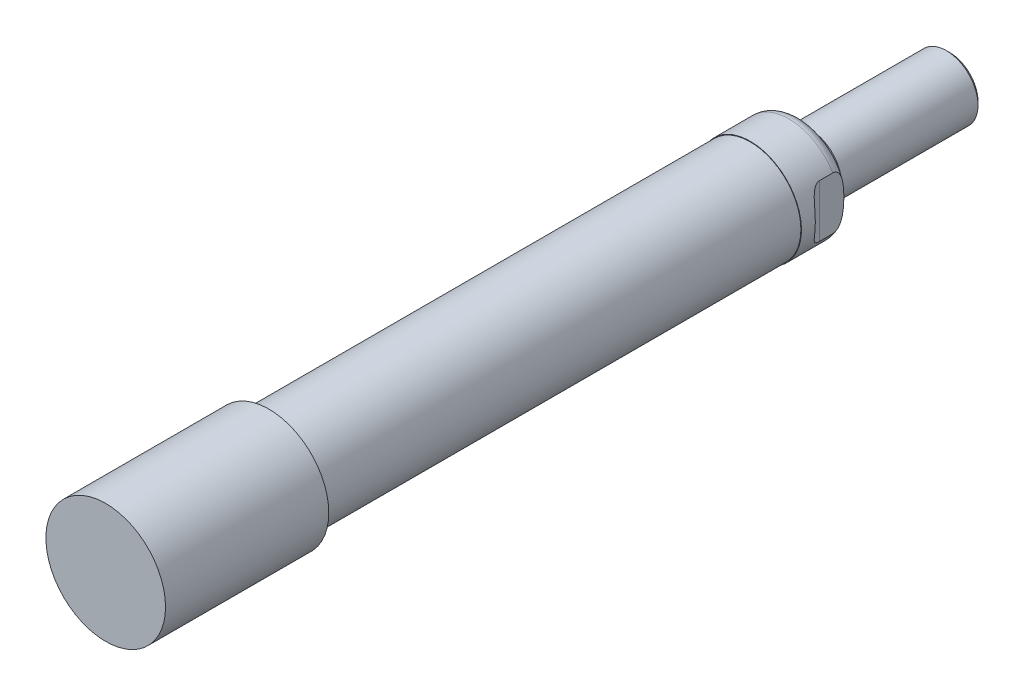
ISO-10303-21;
HEADER;
FILE_DESCRIPTION(('STEP AP214'),'2;1');
FILE_NAME('part.step','',(''),(''),'','','');
FILE_SCHEMA(('AUTOMOTIVE_DESIGN { 1 0 10303 214 1 1 1 1 }'));
ENDSEC;
DATA;
#1=APPLICATION_CONTEXT('core data for automotive mechanical design processes');
#2=APPLICATION_PROTOCOL_DEFINITION('international standard','automotive_design',2000,#1);
#3=PRODUCT_CONTEXT('',#1,'mechanical');
#4=PRODUCT('Part','Part','',(#3));
#5=PRODUCT_RELATED_PRODUCT_CATEGORY('part','',(#4));
#6=PRODUCT_DEFINITION_FORMATION('','',#4);
#7=PRODUCT_DEFINITION_CONTEXT('part definition',#1,'design');
#8=PRODUCT_DEFINITION('design','',#6,#7);
#9=PRODUCT_DEFINITION_SHAPE('','',#8);
#10=(LENGTH_UNIT() NAMED_UNIT(*) SI_UNIT(.MILLI.,.METRE.));
#11=(NAMED_UNIT(*) PLANE_ANGLE_UNIT() SI_UNIT($,.RADIAN.));
#12=(NAMED_UNIT(*) SI_UNIT($,.STERADIAN.) SOLID_ANGLE_UNIT());
#13=UNCERTAINTY_MEASURE_WITH_UNIT(LENGTH_MEASURE(1.E-05),#10,'distance_accuracy_value','');
#14=(GEOMETRIC_REPRESENTATION_CONTEXT(3) GLOBAL_UNCERTAINTY_ASSIGNED_CONTEXT((#13)) GLOBAL_UNIT_ASSIGNED_CONTEXT((#10,
#11,#12)) REPRESENTATION_CONTEXT('',''));
#15=CARTESIAN_POINT('',(0.,0.,0.));
#16=DIRECTION('',(0.,0.,1.));
#17=DIRECTION('',(1.,0.,0.));
#18=AXIS2_PLACEMENT_3D('',#15,#16,#17);
#19=CARTESIAN_POINT('',(0.,0.,0.));
#20=DIRECTION('',(0.,0.,1.));
#21=DIRECTION('',(1.,0.,0.));
#22=AXIS2_PLACEMENT_3D('',#19,#20,#21);
#23=CYLINDRICAL_SURFACE('',#22,12.69238);
#24=CARTESIAN_POINT('',(0.,0.,0.));
#25=DIRECTION('',(0.,0.,1.));
#26=DIRECTION('',(1.,0.,0.));
#27=AXIS2_PLACEMENT_3D('',#24,#25,#26);
#28=CIRCLE('',#27,12.69238);
#29=CARTESIAN_POINT('',(12.69238,0.,0.));
#30=VERTEX_POINT('',#29);
#31=EDGE_CURVE('E29',#30,#30,#28,.T.);
#32=ORIENTED_EDGE('',*,*,#31,.F.);
#33=EDGE_LOOP('',(#32));
#34=FACE_BOUND('',#33,.T.);
#35=CARTESIAN_POINT('',(0.,0.,-120.69739999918));
#36=DIRECTION('',(0.,0.,1.));
#37=DIRECTION('',(1.,0.,0.));
#38=AXIS2_PLACEMENT_3D('',#35,#36,#37);
#39=CIRCLE('',#38,12.69238);
#40=CARTESIAN_POINT('',(12.69238,0.,-120.69739999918));
#41=VERTEX_POINT('',#40);
#42=EDGE_CURVE('E10',#41,#41,#39,.T.);
#43=ORIENTED_EDGE('',*,*,#42,.T.);
#44=EDGE_LOOP('',(#43));
#45=FACE_BOUND('',#44,.T.);
#46=ADVANCED_FACE('F16',(#34,#45),#23,.T.);
#47=CARTESIAN_POINT('',(0.,0.,40.937999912));
#48=DIRECTION('',(0.,0.,-1.));
#49=DIRECTION('',(-1.,0.,0.));
#50=AXIS2_PLACEMENT_3D('',#47,#48,#49);
#51=PLANE('',#50);
#52=CARTESIAN_POINT('',(0.,0.,40.937999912));
#53=DIRECTION('',(0.,0.,1.));
#54=DIRECTION('',(1.,0.,0.));
#55=AXIS2_PLACEMENT_3D('',#52,#53,#54);
#56=CIRCLE('',#55,15.);
#57=CARTESIAN_POINT('',(15.,0.,40.937999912));
#58=VERTEX_POINT('',#57);
#59=EDGE_CURVE('E203',#58,#58,#56,.T.);
#60=ORIENTED_EDGE('',*,*,#59,.T.);
#61=EDGE_LOOP('',(#60));
#62=FACE_BOUND('',#61,.T.);
#63=ADVANCED_FACE('F177',(#62),#51,.F.);
#64=CARTESIAN_POINT('',(0.,0.,0.));
#65=DIRECTION('',(0.,0.,1.));
#66=DIRECTION('',(1.,0.,0.));
#67=AXIS2_PLACEMENT_3D('',#64,#65,#66);
#68=CYLINDRICAL_SURFACE('',#67,15.);
#69=ORIENTED_EDGE('',*,*,#59,.F.);
#70=EDGE_LOOP('',(#69));
#71=FACE_BOUND('',#70,.T.);
#72=CARTESIAN_POINT('',(0.,0.,0.));
#73=DIRECTION('',(0.,0.,1.));
#74=DIRECTION('',(1.,0.,0.));
#75=AXIS2_PLACEMENT_3D('',#72,#73,#74);
#76=CIRCLE('',#75,15.);
#77=CARTESIAN_POINT('',(15.,0.,0.));
#78=VERTEX_POINT('',#77);
#79=EDGE_CURVE('E201',#78,#78,#76,.T.);
#80=ORIENTED_EDGE('',*,*,#79,.T.);
#81=EDGE_LOOP('',(#80));
#82=FACE_BOUND('',#81,.T.);
#83=ADVANCED_FACE('F184',(#71,#82),#68,.T.);
#84=CARTESIAN_POINT('',(0.,15.,0.));
#85=DIRECTION('',(0.,0.,1.));
#86=DIRECTION('',(1.,0.,0.));
#87=AXIS2_PLACEMENT_3D('',#84,#85,#86);
#88=PLANE('',#87);
#89=ORIENTED_EDGE('',*,*,#79,.F.);
#90=EDGE_LOOP('',(#89));
#91=FACE_BOUND('',#90,.T.);
#92=ORIENTED_EDGE('',*,*,#31,.T.);
#93=EDGE_LOOP('',(#92));
#94=FACE_BOUND('',#93,.T.);
#95=ADVANCED_FACE('F139',(#91,#94),#88,.F.);
#96=CARTESIAN_POINT('',(0.,0.,-170.73539999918));
#97=DIRECTION('',(0.,0.,1.));
#98=DIRECTION('',(1.,0.,0.));
#99=AXIS2_PLACEMENT_3D('',#96,#97,#98);
#100=PLANE('',#99);
#101=CARTESIAN_POINT('',(0.,0.,-170.73539999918));
#102=DIRECTION('',(0.,0.,1.));
#103=DIRECTION('',(1.,0.,0.));
#104=AXIS2_PLACEMENT_3D('',#101,#102,#103);
#105=CIRCLE('',#104,7.0685);
#106=CARTESIAN_POINT('',(7.0685,0.,-170.73539999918));
#107=VERTEX_POINT('',#106);
#108=EDGE_CURVE('E89',#107,#107,#105,.T.);
#109=ORIENTED_EDGE('',*,*,#108,.F.);
#110=EDGE_LOOP('',(#109));
#111=FACE_BOUND('',#110,.T.);
#112=ADVANCED_FACE('F135',(#111),#100,.F.);
#113=CARTESIAN_POINT('',(0.,0.,-170.73539999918));
#114=DIRECTION('',(0.,0.,1.));
#115=DIRECTION('',(1.,0.,0.));
#116=AXIS2_PLACEMENT_3D('',#113,#114,#115);
#117=CONICAL_SURFACE('',#116,7.0685,0.785398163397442);
#118=CARTESIAN_POINT('',(0.,0.,-169.87889999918));
#119=DIRECTION('',(0.,0.,1.));
#120=DIRECTION('',(1.,0.,0.));
#121=AXIS2_PLACEMENT_3D('',#118,#119,#120);
#122=CIRCLE('',#121,7.925);
#123=CARTESIAN_POINT('',(7.925,0.,-169.87889999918));
#124=VERTEX_POINT('',#123);
#125=EDGE_CURVE('E92',#124,#124,#122,.T.);
#126=ORIENTED_EDGE('',*,*,#125,.F.);
#127=EDGE_LOOP('',(#126));
#128=FACE_BOUND('',#127,.T.);
#129=ORIENTED_EDGE('',*,*,#108,.T.);
#130=EDGE_LOOP('',(#129));
#131=FACE_BOUND('',#130,.T.);
#132=ADVANCED_FACE('F138',(#128,#131),#117,.T.);
#133=CARTESIAN_POINT('',(0.,0.,-95.5538097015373));
#134=DIRECTION('',(0.,0.,1.));
#135=DIRECTION('',(1.,0.,0.));
#136=AXIS2_PLACEMENT_3D('',#133,#134,#135);
#137=CYLINDRICAL_SURFACE('',#136,7.925);
#138=CARTESIAN_POINT('',(0.,0.,-135.68339999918));
#139=DIRECTION('',(0.,0.,1.));
#140=DIRECTION('',(1.,0.,0.));
#141=AXIS2_PLACEMENT_3D('',#138,#139,#140);
#142=CIRCLE('',#141,7.925);
#143=CARTESIAN_POINT('',(7.925,0.,-135.68339999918));
#144=VERTEX_POINT('',#143);
#145=EDGE_CURVE('E95',#144,#144,#142,.T.);
#146=ORIENTED_EDGE('',*,*,#145,.F.);
#147=EDGE_LOOP('',(#146));
#148=FACE_BOUND('',#147,.T.);
#149=ORIENTED_EDGE('',*,*,#125,.T.);
#150=EDGE_LOOP('',(#149));
#151=FACE_BOUND('',#150,.T.);
#152=ADVANCED_FACE('F143',(#148,#151),#137,.T.);
#153=CARTESIAN_POINT('',(0.,6.8961,-135.68339999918));
#154=DIRECTION('',(0.,0.,-1.));
#155=DIRECTION('',(-1.,0.,0.));
#156=AXIS2_PLACEMENT_3D('',#153,#154,#155);
#157=PLANE('',#156);
#158=CARTESIAN_POINT('',(0.,0.,-135.68339999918));
#159=DIRECTION('',(0.,0.,1.));
#160=DIRECTION('',(1.,0.,0.));
#161=AXIS2_PLACEMENT_3D('',#158,#159,#160);
#162=CIRCLE('',#161,6.8961);
#163=CARTESIAN_POINT('',(6.8961,0.,-135.68339999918));
#164=VERTEX_POINT('',#163);
#165=EDGE_CURVE('E98',#164,#164,#162,.T.);
#166=ORIENTED_EDGE('',*,*,#165,.F.);
#167=EDGE_LOOP('',(#166));
#168=FACE_BOUND('',#167,.T.);
#169=ORIENTED_EDGE('',*,*,#145,.T.);
#170=EDGE_LOOP('',(#169));
#171=FACE_BOUND('',#170,.T.);
#172=ADVANCED_FACE('F147',(#168,#171),#157,.F.);
#173=CARTESIAN_POINT('',(0.,0.,-135.49289999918));
#174=DIRECTION('',(0.,0.,1.));
#175=DIRECTION('',(1.,0.,0.));
#176=AXIS2_PLACEMENT_3D('',#173,#174,#175);
#177=TOROIDAL_SURFACE('',#176,6.8961,0.1905);
#178=CARTESIAN_POINT('',(0.,0.,-135.49289999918));
#179=DIRECTION('',(0.,0.,1.));
#180=DIRECTION('',(1.,0.,0.));
#181=AXIS2_PLACEMENT_3D('',#178,#179,#180);
#182=CIRCLE('',#181,6.7056);
#183=CARTESIAN_POINT('',(6.7056,0.,-135.49289999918));
#184=VERTEX_POINT('',#183);
#185=EDGE_CURVE('E101',#184,#184,#182,.T.);
#186=ORIENTED_EDGE('',*,*,#185,.F.);
#187=EDGE_LOOP('',(#186));
#188=FACE_BOUND('',#187,.T.);
#189=ORIENTED_EDGE('',*,*,#165,.T.);
#190=EDGE_LOOP('',(#189));
#191=FACE_BOUND('',#190,.T.);
#192=ADVANCED_FACE('F151',(#188,#191),#177,.F.);
#193=CARTESIAN_POINT('',(0.,0.,-95.5538097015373));
#194=DIRECTION('',(0.,0.,1.));
#195=DIRECTION('',(1.,0.,0.));
#196=AXIS2_PLACEMENT_3D('',#193,#194,#195);
#197=CYLINDRICAL_SURFACE('',#196,6.7056);
#198=CARTESIAN_POINT('',(0.,0.,-133.58789999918));
#199=DIRECTION('',(0.,0.,1.));
#200=DIRECTION('',(1.,0.,0.));
#201=AXIS2_PLACEMENT_3D('',#198,#199,#200);
#202=CIRCLE('',#201,6.7056);
#203=CARTESIAN_POINT('',(6.7056,0.,-133.58789999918));
#204=VERTEX_POINT('',#203);
#205=EDGE_CURVE('E104',#204,#204,#202,.T.);
#206=ORIENTED_EDGE('',*,*,#205,.F.);
#207=EDGE_LOOP('',(#206));
#208=FACE_BOUND('',#207,.T.);
#209=ORIENTED_EDGE('',*,*,#185,.T.);
#210=EDGE_LOOP('',(#209));
#211=FACE_BOUND('',#210,.T.);
#212=ADVANCED_FACE('F155',(#208,#211),#197,.T.);
#213=CARTESIAN_POINT('',(0.,0.,-133.58789999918));
#214=DIRECTION('',(0.,0.,1.));
#215=DIRECTION('',(1.,0.,0.));
#216=AXIS2_PLACEMENT_3D('',#213,#214,#215);
#217=TOROIDAL_SURFACE('',#216,6.8961,0.1905);
#218=CARTESIAN_POINT('',(0.,0.,-133.39739999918));
#219=DIRECTION('',(0.,0.,1.));
#220=DIRECTION('',(1.,0.,0.));
#221=AXIS2_PLACEMENT_3D('',#218,#219,#220);
#222=CIRCLE('',#221,6.8961);
#223=CARTESIAN_POINT('',(6.8961,0.,-133.39739999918));
#224=VERTEX_POINT('',#223);
#225=EDGE_CURVE('E107',#224,#224,#222,.T.);
#226=ORIENTED_EDGE('',*,*,#225,.F.);
#227=EDGE_LOOP('',(#226));
#228=FACE_BOUND('',#227,.T.);
#229=ORIENTED_EDGE('',*,*,#205,.T.);
#230=EDGE_LOOP('',(#229));
#231=FACE_BOUND('',#230,.T.);
#232=ADVANCED_FACE('F159',(#228,#231),#217,.F.);
#233=CARTESIAN_POINT('',(0.,9.827,-133.39739999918));
#234=DIRECTION('',(0.,0.,1.));
#235=DIRECTION('',(1.,0.,0.));
#236=AXIS2_PLACEMENT_3D('',#233,#234,#235);
#237=PLANE('',#236);
#238=CARTESIAN_POINT('',(0.,0.,-133.39739999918));
#239=DIRECTION('',(0.,0.,1.));
#240=DIRECTION('',(1.,0.,0.));
#241=AXIS2_PLACEMENT_3D('',#238,#239,#240);
#242=CIRCLE('',#241,9.827);
#243=CARTESIAN_POINT('',(9.827,0.,-133.39739999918));
#244=VERTEX_POINT('',#243);
#245=EDGE_CURVE('E110',#244,#244,#242,.T.);
#246=ORIENTED_EDGE('',*,*,#245,.F.);
#247=EDGE_LOOP('',(#246));
#248=FACE_BOUND('',#247,.T.);
#249=ORIENTED_EDGE('',*,*,#225,.T.);
#250=EDGE_LOOP('',(#249));
#251=FACE_BOUND('',#250,.T.);
#252=ADVANCED_FACE('F162',(#248,#251),#237,.F.);
#253=CARTESIAN_POINT('',(14.175,-13.589,-127.04739999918));
#254=DIRECTION('',(0.,1.,0.));
#255=DIRECTION('',(0.,0.,1.));
#256=AXIS2_PLACEMENT_3D('',#253,#254,#255);
#257=CYLINDRICAL_SURFACE('',#256,3.175);
#258=DIRECTION('',(0.,1.,0.));
#259=VECTOR('',#258,1.);
#260=CARTESIAN_POINT('',(11.,-13.589,-127.04739999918));
#261=LINE('',#260,#259);
#262=CARTESIAN_POINT('',(11.,-6.59787306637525,-127.04739999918));
#263=VERTEX_POINT('',#262);
#264=CARTESIAN_POINT('',(11.,6.59787306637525,-127.04739999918));
#265=VERTEX_POINT('',#264);
#266=EDGE_CURVE('E67',#263,#265,#261,.T.);
#267=ORIENTED_EDGE('',*,*,#266,.T.);
#268=CARTESIAN_POINT('',(12.827,0.,-129.922034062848));
#269=CARTESIAN_POINT('',(12.8270006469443,-0.268706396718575,-129.922032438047));
#270=CARTESIAN_POINT('',(12.8185521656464,-0.537405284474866,-129.918117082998));
#271=CARTESIAN_POINT('',(12.7848168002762,-1.07356137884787,-129.901935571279));
#272=CARTESIAN_POINT('',(12.7595266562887,-1.34101833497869,-129.889667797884));
#273=CARTESIAN_POINT('',(12.6924264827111,-1.87235964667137,-129.855249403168));
#274=CARTESIAN_POINT('',(12.6506688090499,-2.13625260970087,-129.833130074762));
#275=CARTESIAN_POINT('',(12.551075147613,-2.65955990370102,-129.776285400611));
#276=CARTESIAN_POINT('',(12.4932481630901,-2.91897665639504,-129.741567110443));
#277=CARTESIAN_POINT('',(12.3955653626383,-3.30135352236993,-129.67717195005));
#278=CARTESIAN_POINT('',(12.3614412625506,-3.42688052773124,-129.653847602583));
#279=CARTESIAN_POINT('',(12.2896809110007,-3.67592818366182,-129.602425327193));
#280=CARTESIAN_POINT('',(12.2520453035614,-3.79944919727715,-129.574328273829));
#281=CARTESIAN_POINT('',(12.1733916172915,-4.04438579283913,-129.512495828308));
#282=CARTESIAN_POINT('',(12.1323645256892,-4.16579465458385,-129.478745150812));
#283=CARTESIAN_POINT('',(12.0473665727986,-4.40557163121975,-129.404724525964));
#284=CARTESIAN_POINT('',(12.0033958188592,-4.52393985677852,-129.364454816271));
#285=CARTESIAN_POINT('',(11.9123351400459,-4.75859923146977,-129.275645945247));
#286=CARTESIAN_POINT('',(11.8652086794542,-4.87483370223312,-129.226993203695));
#287=CARTESIAN_POINT('',(11.7691575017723,-5.10236285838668,-129.120488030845));
#288=CARTESIAN_POINT('',(11.7202319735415,-5.21365526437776,-129.062631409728));
#289=CARTESIAN_POINT('',(11.621957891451,-5.429177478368,-128.936568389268));
#290=CARTESIAN_POINT('',(11.5726129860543,-5.53344179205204,-128.868418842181));
#291=CARTESIAN_POINT('',(11.4748714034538,-5.73337583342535,-128.720065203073));
#292=CARTESIAN_POINT('',(11.4264734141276,-5.82905822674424,-128.639879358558));
#293=CARTESIAN_POINT('',(11.3379215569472,-5.99930417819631,-128.475456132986));
#294=CARTESIAN_POINT('',(11.2974443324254,-6.07503291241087,-128.392615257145));
#295=CARTESIAN_POINT('',(11.2211290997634,-6.21486401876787,-128.21554189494));
#296=CARTESIAN_POINT('',(11.1852916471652,-6.27896499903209,-128.121308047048));
#297=CARTESIAN_POINT('',(11.1206016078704,-6.39284793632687,-127.920611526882));
#298=CARTESIAN_POINT('',(11.0918341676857,-6.44245658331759,-127.81402058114));
#299=CARTESIAN_POINT('',(11.0449485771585,-6.52251798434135,-127.591669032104));
#300=CARTESIAN_POINT('',(11.0268129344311,-6.55300220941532,-127.475923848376));
#301=CARTESIAN_POINT('',(11.0050476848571,-6.58948010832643,-127.254354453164));
#302=CARTESIAN_POINT('',(10.9998823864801,-6.59806860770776,-127.14910976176));
#303=CARTESIAN_POINT('',(11.0001214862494,-6.59767106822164,-126.938676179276));
#304=CARTESIAN_POINT('',(11.0055222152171,-6.5886911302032,-126.833487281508));
#305=CARTESIAN_POINT('',(11.0249837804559,-6.55606201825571,-126.639506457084));
#306=CARTESIAN_POINT('',(11.0379211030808,-6.53431349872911,-126.550267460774));
#307=CARTESIAN_POINT('',(11.0703780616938,-6.47917273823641,-126.376769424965));
#308=CARTESIAN_POINT('',(11.0898991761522,-6.4457778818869,-126.292511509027));
#309=CARTESIAN_POINT('',(11.142561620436,-6.354443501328,-126.09957879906));
#310=CARTESIAN_POINT('',(11.1780628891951,-6.29199722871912,-125.9936872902));
#311=CARTESIAN_POINT('',(11.2555606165,-6.15228870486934,-125.79481926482));
#312=CARTESIAN_POINT('',(11.2975704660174,-6.07499582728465,-125.701870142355));
#313=CARTESIAN_POINT('',(11.3740280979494,-5.93028966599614,-125.550595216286));
#314=CARTESIAN_POINT('',(11.4076958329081,-5.86533333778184,-125.489463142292));
#315=CARTESIAN_POINT('',(11.4761103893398,-5.7303179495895,-125.373738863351));
#316=CARTESIAN_POINT('',(11.5108577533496,-5.66025629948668,-125.319150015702));
#317=CARTESIAN_POINT('',(11.580721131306,-5.51591033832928,-125.215943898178));
#318=CARTESIAN_POINT('',(11.6158375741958,-5.44162053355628,-125.167334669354));
#319=CARTESIAN_POINT('',(11.6858415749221,-5.28961727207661,-125.075588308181));
#320=CARTESIAN_POINT('',(11.7207290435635,-5.21190256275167,-125.032453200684));
#321=CARTESIAN_POINT('',(11.8154406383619,-4.99498140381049,-124.920954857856));
#322=CARTESIAN_POINT('',(11.8745797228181,-4.85289540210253,-124.857592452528));
#323=CARTESIAN_POINT('',(11.9891935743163,-4.56241341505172,-124.743181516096));
#324=CARTESIAN_POINT('',(12.0446655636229,-4.41401278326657,-124.69214224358));
#325=CARTESIAN_POINT('',(12.1510125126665,-4.11223366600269,-124.60014702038));
#326=CARTESIAN_POINT('',(12.2018792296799,-3.95884689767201,-124.559208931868));
#327=CARTESIAN_POINT('',(12.2982733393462,-3.64840228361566,-124.485722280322));
#328=CARTESIAN_POINT('',(12.3437989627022,-3.49134324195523,-124.453176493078));
#329=CARTESIAN_POINT('',(12.4233553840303,-3.19567884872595,-124.398936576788));
#330=CARTESIAN_POINT('',(12.4581089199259,-3.05742452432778,-124.376372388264));
#331=CARTESIAN_POINT('',(12.5231131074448,-2.77920652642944,-124.335692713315));
#332=CARTESIAN_POINT('',(12.553363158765,-2.63924262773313,-124.317577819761));
#333=CARTESIAN_POINT('',(12.6371794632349,-2.21717598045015,-124.268915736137));
#334=CARTESIAN_POINT('',(12.6837855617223,-1.93299577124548,-124.244067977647));
#335=CARTESIAN_POINT('',(12.7578770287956,-1.36086538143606,-124.205904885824));
#336=CARTESIAN_POINT('',(12.7853224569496,-1.0729085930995,-124.192613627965));
#337=CARTESIAN_POINT('',(12.8206829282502,-0.495595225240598,-124.175669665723));
#338=CARTESIAN_POINT('',(12.8286032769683,-0.206239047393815,-124.172014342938));
#339=CARTESIAN_POINT('',(12.8247765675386,0.385076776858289,-124.173808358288));
#340=CARTESIAN_POINT('',(12.8121465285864,0.687029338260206,-124.179666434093));
#341=CARTESIAN_POINT('',(12.76563105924,1.28908038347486,-124.202228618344));
#342=CARTESIAN_POINT('',(12.7317365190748,1.58917801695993,-124.218937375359));
#343=CARTESIAN_POINT('',(12.6653524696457,2.0355131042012,-124.254161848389));
#344=CARTESIAN_POINT('',(12.640698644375,2.18336505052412,-124.267560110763));
#345=CARTESIAN_POINT('',(12.5863116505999,2.47771503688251,-124.298276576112));
#346=CARTESIAN_POINT('',(12.5565791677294,2.62421325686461,-124.315594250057));
#347=CARTESIAN_POINT('',(12.4921854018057,2.9153814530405,-124.354784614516));
#348=CARTESIAN_POINT('',(12.4575282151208,3.06005284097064,-124.376653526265));
#349=CARTESIAN_POINT('',(12.3834551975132,3.34722888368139,-124.425764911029));
#350=CARTESIAN_POINT('',(12.3440405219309,3.48973405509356,-124.453006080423));
#351=CARTESIAN_POINT('',(12.2718676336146,3.73427642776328,-124.505720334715));
#352=CARTESIAN_POINT('',(12.2401497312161,3.8369403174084,-124.529716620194));
#353=CARTESIAN_POINT('',(12.1744548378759,4.04054657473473,-124.581594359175));
#354=CARTESIAN_POINT('',(12.1404780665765,4.14148910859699,-124.609475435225));
#355=CARTESIAN_POINT('',(12.0704124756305,4.34146410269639,-124.669696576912));
#356=CARTESIAN_POINT('',(12.0343208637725,4.44049379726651,-124.702042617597));
#357=CARTESIAN_POINT('',(11.9603330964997,4.63608580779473,-124.771776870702));
#358=CARTESIAN_POINT('',(11.9224369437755,4.73264812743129,-124.809165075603));
#359=CARTESIAN_POINT('',(11.8448111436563,4.92372983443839,-124.890082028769));
#360=CARTESIAN_POINT('',(11.8050669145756,5.0182190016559,-124.933668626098));
#361=CARTESIAN_POINT('',(11.724597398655,5.20345470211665,-125.027505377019));
#362=CARTESIAN_POINT('',(11.6838718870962,5.29420036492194,-125.077757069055));
#363=CARTESIAN_POINT('',(11.6022467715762,5.47076103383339,-125.185645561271));
#364=CARTESIAN_POINT('',(11.5613479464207,5.55658882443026,-125.243261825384));
#365=CARTESIAN_POINT('',(11.4802322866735,5.72229837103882,-125.366831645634));
#366=CARTESIAN_POINT('',(11.4400149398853,5.802184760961,-125.432778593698));
#367=CARTESIAN_POINT('',(11.3572443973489,5.96271064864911,-125.581494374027));
#368=CARTESIAN_POINT('',(11.3149050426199,6.04250744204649,-125.665309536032));
#369=CARTESIAN_POINT('',(11.2348293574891,6.19012083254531,-125.845033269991));
#370=CARTESIAN_POINT('',(11.1970931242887,6.25793717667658,-125.940942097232));
#371=CARTESIAN_POINT('',(11.128715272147,6.3787552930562,-126.145969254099));
#372=CARTESIAN_POINT('',(11.098168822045,6.43156007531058,-126.255238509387));
#373=CARTESIAN_POINT('',(11.0482516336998,6.51694473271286,-126.483795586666));
#374=CARTESIAN_POINT('',(11.0288594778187,6.54956337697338,-126.603063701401));
#375=CARTESIAN_POINT('',(11.0057736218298,6.58827028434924,-126.829199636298));
#376=CARTESIAN_POINT('',(11.0001989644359,6.59754065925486,-126.935330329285));
#377=CARTESIAN_POINT('',(10.9998120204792,6.59818715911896,-127.147657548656));
#378=CARTESIAN_POINT('',(11.0049956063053,6.58957014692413,-127.253854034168));
#379=CARTESIAN_POINT('',(11.0241644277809,6.55743862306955,-127.448936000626));
#380=CARTESIAN_POINT('',(11.0369358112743,6.53597607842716,-127.538295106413));
#381=CARTESIAN_POINT('',(11.0690932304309,6.48136604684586,-127.712068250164));
#382=CARTESIAN_POINT('',(11.0884805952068,6.44821621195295,-127.796481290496));
#383=CARTESIAN_POINT('',(11.1407633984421,6.35759036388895,-127.989422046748));
#384=CARTESIAN_POINT('',(11.176000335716,6.29565265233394,-128.095213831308));
#385=CARTESIAN_POINT('',(11.2529937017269,6.15697528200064,-128.293968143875));
#386=CARTESIAN_POINT('',(11.294763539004,6.08020510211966,-128.3869035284));
#387=CARTESIAN_POINT('',(11.370782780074,5.93650304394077,-128.53810818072));
#388=CARTESIAN_POINT('',(11.4042410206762,5.87203904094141,-128.599180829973));
#389=CARTESIAN_POINT('',(11.4722553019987,5.73802693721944,-128.714820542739));
#390=CARTESIAN_POINT('',(11.5068118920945,5.66847626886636,-128.769384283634));
#391=CARTESIAN_POINT('',(11.6110663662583,5.45346713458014,-128.924214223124));
#392=CARTESIAN_POINT('',(11.6812870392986,5.30176672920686,-129.015503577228));
#393=CARTESIAN_POINT('',(11.810013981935,5.00778913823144,-129.167785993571));
#394=CARTESIAN_POINT('',(11.8688574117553,4.86684600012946,-129.231173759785));
#395=CARTESIAN_POINT('',(11.9830054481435,4.57859491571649,-129.345730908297));
#396=CARTESIAN_POINT('',(12.0383073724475,4.43128228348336,-129.396891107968));
#397=CARTESIAN_POINT('',(12.1443997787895,4.1316839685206,-129.489168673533));
#398=CARTESIAN_POINT('',(12.1951815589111,3.97938943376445,-129.53026692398));
#399=CARTESIAN_POINT('',(12.2914956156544,3.67112407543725,-129.60410019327));
#400=CARTESIAN_POINT('',(12.3370261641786,3.51515206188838,-129.636832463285));
#401=CARTESIAN_POINT('',(12.4162972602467,3.22289185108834,-129.691176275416));
#402=CARTESIAN_POINT('',(12.4507928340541,3.08697610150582,-129.713708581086));
#403=CARTESIAN_POINT('',(12.5154354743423,2.81346117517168,-129.754413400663));
#404=CARTESIAN_POINT('',(12.5455819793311,2.67586178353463,-129.772585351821));
#405=CARTESIAN_POINT('',(12.6293223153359,2.2609156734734,-129.821521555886));
#406=CARTESIAN_POINT('',(12.6761913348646,1.98151526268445,-129.846689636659));
#407=CARTESIAN_POINT('',(12.7514128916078,1.41916990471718,-129.885672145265));
#408=CARTESIAN_POINT('',(12.7797420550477,1.13622093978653,-129.899472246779));
#409=CARTESIAN_POINT('',(12.8175325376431,0.568844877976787,-129.917652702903));
#410=CARTESIAN_POINT('',(12.8269993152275,0.284418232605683,-129.922035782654));
#411=CARTESIAN_POINT('',(12.827,0.,-129.922034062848));
#412=B_SPLINE_CURVE_WITH_KNOTS('',3,(#268,#269,#270,#271,#272,#273,#274,#275,#276,#277,#278,
#279,#280,#281,#282,#283,#284,#285,#286,#287,#288,#289,#290,#291,#292,#293,#294,#295,#296,#297,
#298,#299,#300,#301,#302,#303,#304,#305,#306,#307,#308,#309,#310,#311,#312,#313,#314,#315,#316,
#317,#318,#319,#320,#321,#322,#323,#324,#325,#326,#327,#328,#329,#330,#331,#332,#333,#334,#335,
#336,#337,#338,#339,#340,#341,#342,#343,#344,#345,#346,#347,#348,#349,#350,#351,#352,#353,#354,
#355,#356,#357,#358,#359,#360,#361,#362,#363,#364,#365,#366,#367,#368,#369,#370,#371,#372,#373,
#374,#375,#376,#377,#378,#379,#380,#381,#382,#383,#384,#385,#386,#387,#388,#389,#390,#391,#392,
#393,#394,#395,#396,#397,#398,#399,#400,#401,#402,#403,#404,#405,#406,#407,#408,#409,#410,#411),
.UNSPECIFIED.,.T.,.F.,(4,2,2,2,2,2,2,2,2,2,2,2,2,2,2,2,2,2,2,2,2,2,2,2,2,2,2,2,2,2,2,2,2,2,2,2,
2,2,2,2,2,2,2,2,2,2,2,2,2,2,2,2,2,2,2,2,2,2,2,2,2,2,2,2,2,2,2,2,2,2,2,4),(0.,0.805944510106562,
1.61204506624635,2.4156031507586,3.21871192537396,3.61506493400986,4.01134539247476,
4.40871507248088,4.80607026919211,5.20930705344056,5.61272792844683,6.01399694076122,
6.41466364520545,6.77161676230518,7.12861257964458,7.48971755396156,7.85022672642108,
8.16546211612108,8.48058805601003,8.75769226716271,9.03485874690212,9.41660872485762,
9.79915482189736,10.0847983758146,10.3705878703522,10.6567575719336,10.9430328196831,
11.4415134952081,11.94036753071,12.44009747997,12.9399925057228,13.3728240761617,
13.8057132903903,14.6717977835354,15.5396822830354,16.4073309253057,17.3132532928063,
18.2195640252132,18.6709220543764,19.1222191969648,19.5731431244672,20.0239577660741,
20.3541623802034,20.6843349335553,21.0149536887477,21.3455719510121,21.6795075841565,
22.0135204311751,22.3466214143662,22.6794598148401,23.0480879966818,23.4167239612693,
23.7899949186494,24.1625467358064,24.4806188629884,24.7985689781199,25.0757488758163,
25.3529844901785,25.7335319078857,26.1148708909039,26.3991682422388,26.6836101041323,
27.2530112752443,27.7484789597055,28.244317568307,28.7410909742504,29.2380273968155,
29.6639465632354,30.0899206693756,30.9421650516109,31.795481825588,32.648551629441),.UNSPECIFIED.);
#413=EDGE_CURVE('E65',#263,#265,#412,.T.);
#414=ORIENTED_EDGE('',*,*,#413,.F.);
#415=EDGE_LOOP('',(#267,#414));
#416=FACE_BOUND('',#415,.T.);
#417=ADVANCED_FACE('F66',(#416),#257,.F.);
#418=CARTESIAN_POINT('',(11.,-13.589,-133.39739999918));
#419=DIRECTION('',(-1.,0.,0.));
#420=DIRECTION('',(0.,0.,1.));
#421=AXIS2_PLACEMENT_3D('',#418,#419,#420);
#422=PLANE('',#421);
#423=CARTESIAN_POINT('',(11.,0.,-133.158572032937));
#424=CARTESIAN_POINT('',(11.,-0.235247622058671,-133.158566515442));
#425=CARTESIAN_POINT('',(11.,-0.470493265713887,-133.155397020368));
#426=CARTESIAN_POINT('',(11.,-0.940835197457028,-133.142316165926));
#427=CARTESIAN_POINT('',(11.,-1.17593146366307,-133.132403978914));
#428=CARTESIAN_POINT('',(11.,-1.64591775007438,-133.104650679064));
#429=CARTESIAN_POINT('',(11.,-1.88080729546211,-133.086801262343));
#430=CARTESIAN_POINT('',(11.,-2.34961125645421,-133.041173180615));
#431=CARTESIAN_POINT('',(11.,-2.58352588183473,-133.013396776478));
#432=CARTESIAN_POINT('',(11.,-2.99896168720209,-132.95240929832));
#433=CARTESIAN_POINT('',(11.,-3.1808422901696,-132.921683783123));
#434=CARTESIAN_POINT('',(11.,-3.54279949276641,-132.850474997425));
#435=CARTESIAN_POINT('',(11.,-3.72287538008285,-132.809988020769));
#436=CARTESIAN_POINT('',(11.,-4.07918992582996,-132.717145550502));
#437=CARTESIAN_POINT('',(11.,-4.25544154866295,-132.664840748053));
#438=CARTESIAN_POINT('',(11.,-4.60279770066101,-132.545474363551));
#439=CARTESIAN_POINT('',(11.,-4.77390771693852,-132.478429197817));
#440=CARTESIAN_POINT('',(11.,-5.07702851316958,-132.340171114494));
#441=CARTESIAN_POINT('',(11.,-5.21041921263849,-132.272020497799));
#442=CARTESIAN_POINT('',(11.,-5.46918637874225,-132.121256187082));
#443=CARTESIAN_POINT('',(11.,-5.59455136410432,-132.038622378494));
#444=CARTESIAN_POINT('',(11.,-5.83424377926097,-131.855585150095));
#445=CARTESIAN_POINT('',(11.,-5.94841927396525,-131.754978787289));
#446=CARTESIAN_POINT('',(11.,-6.15698920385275,-131.534977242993));
#447=CARTESIAN_POINT('',(11.,-6.25144900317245,-131.415646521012));
#448=CARTESIAN_POINT('',(11.,-6.38205172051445,-131.205902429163));
#449=CARTESIAN_POINT('',(11.,-6.42688252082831,-131.120904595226));
#450=CARTESIAN_POINT('',(11.,-6.50221817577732,-130.944737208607));
#451=CARTESIAN_POINT('',(11.,-6.53273441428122,-130.853572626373));
#452=CARTESIAN_POINT('',(11.,-6.57724977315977,-130.666596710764));
#453=CARTESIAN_POINT('',(11.,-6.59113988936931,-130.570758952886));
#454=CARTESIAN_POINT('',(11.,-6.60075639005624,-130.378173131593));
#455=CARTESIAN_POINT('',(11.,-6.59648730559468,-130.281425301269));
#456=CARTESIAN_POINT('',(11.,-6.57141197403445,-130.099106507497));
#457=CARTESIAN_POINT('',(11.,-6.55213996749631,-130.013317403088));
#458=CARTESIAN_POINT('',(11.,-6.50034463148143,-129.845879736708));
#459=CARTESIAN_POINT('',(11.,-6.46781725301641,-129.764232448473));
#460=CARTESIAN_POINT('',(11.,-6.37860257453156,-129.579986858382));
#461=CARTESIAN_POINT('',(11.,-6.31747124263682,-129.479544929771));
#462=CARTESIAN_POINT('',(11.,-6.17978674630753,-129.289848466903));
#463=CARTESIAN_POINT('',(11.,-6.10319990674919,-129.200619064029));
#464=CARTESIAN_POINT('',(11.,-5.89835405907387,-128.992212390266));
#465=CARTESIAN_POINT('',(11.,-5.76319645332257,-128.879863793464));
#466=CARTESIAN_POINT('',(11.,-5.47762736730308,-128.677113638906));
#467=CARTESIAN_POINT('',(11.,-5.3271955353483,-128.586741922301));
#468=CARTESIAN_POINT('',(11.,-5.03096035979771,-128.43163530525));
#469=CARTESIAN_POINT('',(11.,-4.88596547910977,-128.365322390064));
#470=CARTESIAN_POINT('',(11.,-4.59078239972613,-128.245296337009));
#471=CARTESIAN_POINT('',(11.,-4.44058958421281,-128.191594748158));
#472=CARTESIAN_POINT('',(11.,-4.13619184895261,-128.09449924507));
#473=CARTESIAN_POINT('',(11.,-3.98197150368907,-128.051154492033));
#474=CARTESIAN_POINT('',(11.,-3.67143699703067,-127.973321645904));
#475=CARTESIAN_POINT('',(11.,-3.51512398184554,-127.938828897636));
#476=CARTESIAN_POINT('',(11.,-3.10051431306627,-127.857399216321));
#477=CARTESIAN_POINT('',(11.,-2.84101265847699,-127.816638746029));
#478=CARTESIAN_POINT('',(11.,-2.32008586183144,-127.749670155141));
#479=CARTESIAN_POINT('',(11.,-2.05865958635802,-127.72347144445));
#480=CARTESIAN_POINT('',(11.,-1.53417590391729,-127.682090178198));
#481=CARTESIAN_POINT('',(11.,-1.27111595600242,-127.666940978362));
#482=CARTESIAN_POINT('',(11.,-0.744724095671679,-127.645581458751));
#483=CARTESIAN_POINT('',(11.,-0.481392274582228,-127.639368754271));
#484=CARTESIAN_POINT('',(11.,0.0455988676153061,-127.634922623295));
#485=CARTESIAN_POINT('',(11.,0.309258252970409,-127.636697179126));
#486=CARTESIAN_POINT('',(11.,0.836458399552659,-127.648519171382));
#487=CARTESIAN_POINT('',(11.,1.09999912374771,-127.658568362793));
#488=CARTESIAN_POINT('',(11.,1.62584348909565,-127.688418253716));
#489=CARTESIAN_POINT('',(11.,1.8881485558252,-127.708192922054));
#490=CARTESIAN_POINT('',(11.,2.41147381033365,-127.760242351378));
#491=CARTESIAN_POINT('',(11.,2.67249453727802,-127.792511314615));
#492=CARTESIAN_POINT('',(11.,3.09542675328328,-127.858674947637));
#493=CARTESIAN_POINT('',(11.,3.25812392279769,-127.887509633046));
#494=CARTESIAN_POINT('',(11.,3.58199478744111,-127.953201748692));
#495=CARTESIAN_POINT('',(11.,3.74316778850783,-127.990062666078));
#496=CARTESIAN_POINT('',(11.,4.06223074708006,-128.073272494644));
#497=CARTESIAN_POINT('',(11.,4.22013305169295,-128.11957327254));
#498=CARTESIAN_POINT('',(11.,4.53201190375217,-128.223764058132));
#499=CARTESIAN_POINT('',(11.,4.68599115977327,-128.281645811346));
#500=CARTESIAN_POINT('',(11.,4.99410080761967,-128.414047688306));
#501=CARTESIAN_POINT('',(11.,5.14798871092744,-128.489142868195));
#502=CARTESIAN_POINT('',(11.,5.44570190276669,-128.657817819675));
#503=CARTESIAN_POINT('',(11.,5.58952250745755,-128.751406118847));
#504=CARTESIAN_POINT('',(11.,5.83221957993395,-128.938478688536));
#505=CARTESIAN_POINT('',(11.,5.93420267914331,-129.02788521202));
#506=CARTESIAN_POINT('',(11.,6.12294376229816,-129.22156927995));
#507=CARTESIAN_POINT('',(11.,6.20973462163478,-129.325813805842));
#508=CARTESIAN_POINT('',(11.,6.34141679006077,-129.519255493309));
#509=CARTESIAN_POINT('',(11.,6.39130707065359,-129.605029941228));
#510=CARTESIAN_POINT('',(11.,6.4765495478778,-129.783585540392));
#511=CARTESIAN_POINT('',(11.,6.51191150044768,-129.87636194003));
#512=CARTESIAN_POINT('',(11.,6.56556463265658,-130.067596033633));
#513=CARTESIAN_POINT('',(11.,6.58372131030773,-130.166092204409));
#514=CARTESIAN_POINT('',(11.,6.60072658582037,-130.364733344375));
#515=CARTESIAN_POINT('',(11.,6.59958533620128,-130.464877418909));
#516=CARTESIAN_POINT('',(11.,6.57940404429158,-130.651535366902));
#517=CARTESIAN_POINT('',(11.,6.56245104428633,-130.738285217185));
#518=CARTESIAN_POINT('',(11.,6.51486797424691,-130.907916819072));
#519=CARTESIAN_POINT('',(11.,6.48423316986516,-130.990797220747));
#520=CARTESIAN_POINT('',(11.,6.40020486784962,-131.175207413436));
#521=CARTESIAN_POINT('',(11.,6.3427415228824,-131.274877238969));
#522=CARTESIAN_POINT('',(11.,6.21243394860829,-131.463566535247));
#523=CARTESIAN_POINT('',(11.,6.13956118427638,-131.552565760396));
#524=CARTESIAN_POINT('',(11.,5.94530576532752,-131.759340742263));
#525=CARTESIAN_POINT('',(11.,5.81727690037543,-131.870829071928));
#526=CARTESIAN_POINT('',(11.,5.54582767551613,-132.072917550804));
#527=CARTESIAN_POINT('',(11.,5.40237638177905,-132.163474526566));
#528=CARTESIAN_POINT('',(11.,5.12144094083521,-132.318333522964));
#529=CARTESIAN_POINT('',(11.,4.98490407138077,-132.384391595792));
#530=CARTESIAN_POINT('',(11.,4.70661680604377,-132.504584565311));
#531=CARTESIAN_POINT('',(11.,4.56486202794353,-132.55870916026));
#532=CARTESIAN_POINT('',(11.,4.27765571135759,-132.656997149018));
#533=CARTESIAN_POINT('',(11.,4.13219693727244,-132.701139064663));
#534=CARTESIAN_POINT('',(11.,3.83894997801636,-132.780964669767));
#535=CARTESIAN_POINT('',(11.,3.69116092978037,-132.816645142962));
#536=CARTESIAN_POINT('',(11.,3.39760623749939,-132.880129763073));
#537=CARTESIAN_POINT('',(11.,3.25187625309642,-132.908101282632));
#538=CARTESIAN_POINT('',(11.,2.95942360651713,-132.958332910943));
#539=CARTESIAN_POINT('',(11.,2.81270078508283,-132.98059207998));
#540=CARTESIAN_POINT('',(11.,2.51851404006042,-133.020289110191));
#541=CARTESIAN_POINT('',(11.,2.37104968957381,-133.037723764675));
#542=CARTESIAN_POINT('',(11.,2.07568722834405,-133.068468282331));
#543=CARTESIAN_POINT('',(11.,1.9277890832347,-133.081777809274));
#544=CARTESIAN_POINT('',(11.,1.48370488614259,-133.116420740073));
#545=CARTESIAN_POINT('',(11.,1.18710469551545,-133.132471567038));
#546=CARTESIAN_POINT('',(11.,0.59366852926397,-133.153548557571));
#547=CARTESIAN_POINT('',(11.,0.296832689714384,-133.158578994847));
#548=CARTESIAN_POINT('',(11.,0.,-133.158572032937));
#549=B_SPLINE_CURVE_WITH_KNOTS('',3,(#423,#424,#425,#426,#427,#428,#429,#430,#431,#432,#433,
#434,#435,#436,#437,#438,#439,#440,#441,#442,#443,#444,#445,#446,#447,#448,#449,#450,#451,#452,
#453,#454,#455,#456,#457,#458,#459,#460,#461,#462,#463,#464,#465,#466,#467,#468,#469,#470,#471,
#472,#473,#474,#475,#476,#477,#478,#479,#480,#481,#482,#483,#484,#485,#486,#487,#488,#489,#490,
#491,#492,#493,#494,#495,#496,#497,#498,#499,#500,#501,#502,#503,#504,#505,#506,#507,#508,#509,
#510,#511,#512,#513,#514,#515,#516,#517,#518,#519,#520,#521,#522,#523,#524,#525,#526,#527,#528,
#529,#530,#531,#532,#533,#534,#535,#536,#537,#538,#539,#540,#541,#542,#543,#544,#545,#546,#547,
#548),.UNSPECIFIED.,.T.,.F.,(4,2,2,2,2,2,2,2,2,2,2,2,2,2,2,2,2,2,2,2,2,2,2,2,2,2,2,2,2,2,2,2,2,
2,2,2,2,2,2,2,2,2,2,2,2,2,2,2,2,2,2,2,2,2,2,2,2,2,2,2,2,2,4),(0.,0.705716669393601,
1.41151997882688,2.11806343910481,2.82444608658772,3.37761348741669,3.93099124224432,
4.48203895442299,5.0324760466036,5.48114601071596,5.93044410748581,6.38517954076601,
6.8383825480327,7.1256030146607,7.41259467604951,7.70145778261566,7.99024881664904,
8.25285984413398,8.51555114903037,8.86633809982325,9.21789777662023,9.74220461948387,
10.2672194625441,10.7448305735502,11.2228773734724,11.7031501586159,12.1831698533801,
12.9705914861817,13.7585213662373,14.5488200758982,15.3389078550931,16.129785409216,
16.9208307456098,17.709770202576,18.4983440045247,18.9938849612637,19.4896416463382,
19.982931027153,20.4758700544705,20.988614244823,21.5015954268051,21.907212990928,
22.3119416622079,22.6085194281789,22.9048977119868,23.2035742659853,23.5020936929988,
23.7660600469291,24.0301178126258,24.3733550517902,24.7172335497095,25.2236859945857,
25.731173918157,26.1855381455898,26.6402930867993,27.0960173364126,27.5519145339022,
27.9969520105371,28.4420626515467,28.887468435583,29.3329105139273,30.223721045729,
31.1141860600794),.UNSPECIFIED.);
#550=CARTESIAN_POINT('',(11.,6.59787306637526,-130.39739999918));
#551=VERTEX_POINT('',#550);
#552=CARTESIAN_POINT('',(11.,-6.59787306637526,-130.39739999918));
#553=VERTEX_POINT('',#552);
#554=EDGE_CURVE('E115',#551,#553,#549,.T.);
#555=ORIENTED_EDGE('',*,*,#554,.F.);
#556=DIRECTION('',(0.,0.,1.));
#557=VECTOR('',#556,1.);
#558=CARTESIAN_POINT('',(11.,6.59787306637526,-95.5538097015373));
#559=LINE('',#558,#557);
#560=EDGE_CURVE('E72',#265,#551,#559,.F.);
#561=ORIENTED_EDGE('',*,*,#560,.F.);
#562=ORIENTED_EDGE('',*,*,#266,.F.);
#563=DIRECTION('',(0.,0.,1.));
#564=VECTOR('',#563,1.);
#565=CARTESIAN_POINT('',(11.,-6.59787306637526,-95.5538097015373));
#566=LINE('',#565,#564);
#567=EDGE_CURVE('E37',#553,#263,#566,.T.);
#568=ORIENTED_EDGE('',*,*,#567,.F.);
#569=EDGE_LOOP('',(#555,#561,#562,#568));
#570=FACE_BOUND('',#569,.T.);
#571=ADVANCED_FACE('F71',(#570),#422,.F.);
#572=CARTESIAN_POINT('',(-14.175,-13.589,-127.04739999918));
#573=DIRECTION('',(0.,1.,0.));
#574=DIRECTION('',(0.,0.,1.));
#575=AXIS2_PLACEMENT_3D('',#572,#573,#574);
#576=CYLINDRICAL_SURFACE('',#575,3.175);
#577=DIRECTION('',(0.,1.,0.));
#578=VECTOR('',#577,1.);
#579=CARTESIAN_POINT('',(-11.,-13.589,-127.04739999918));
#580=LINE('',#579,#578);
#581=CARTESIAN_POINT('',(-11.,-6.59787306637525,-127.04739999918));
#582=VERTEX_POINT('',#581);
#583=CARTESIAN_POINT('',(-11.,6.59787306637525,-127.04739999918));
#584=VERTEX_POINT('',#583);
#585=EDGE_CURVE('E73',#582,#584,#580,.T.);
#586=ORIENTED_EDGE('',*,*,#585,.F.);
#587=CARTESIAN_POINT('',(-12.827,0.,-129.922034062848));
#588=CARTESIAN_POINT('',(-12.8270006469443,0.268706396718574,-129.922032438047));
#589=CARTESIAN_POINT('',(-12.8185521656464,0.537405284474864,-129.918117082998));
#590=CARTESIAN_POINT('',(-12.7848168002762,1.07356137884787,-129.901935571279));
#591=CARTESIAN_POINT('',(-12.7595266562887,1.34101833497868,-129.889667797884));
#592=CARTESIAN_POINT('',(-12.6924264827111,1.87235964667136,-129.855249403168));
#593=CARTESIAN_POINT('',(-12.6506688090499,2.13625260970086,-129.833130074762));
#594=CARTESIAN_POINT('',(-12.551075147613,2.65955990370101,-129.776285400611));
#595=CARTESIAN_POINT('',(-12.4932481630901,2.91897665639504,-129.741567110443));
#596=CARTESIAN_POINT('',(-12.3955653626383,3.30135352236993,-129.67717195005));
#597=CARTESIAN_POINT('',(-12.3614412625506,3.42688052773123,-129.653847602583));
#598=CARTESIAN_POINT('',(-12.2896809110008,3.67592818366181,-129.602425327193));
#599=CARTESIAN_POINT('',(-12.2520453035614,3.79944919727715,-129.574328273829));
#600=CARTESIAN_POINT('',(-12.1733916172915,4.04438579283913,-129.512495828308));
#601=CARTESIAN_POINT('',(-12.1323645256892,4.16579465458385,-129.478745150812));
#602=CARTESIAN_POINT('',(-12.0473665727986,4.40557163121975,-129.404724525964));
#603=CARTESIAN_POINT('',(-12.0033958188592,4.52393985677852,-129.364454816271));
#604=CARTESIAN_POINT('',(-11.9123351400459,4.75859923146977,-129.275645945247));
#605=CARTESIAN_POINT('',(-11.8652086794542,4.87483370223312,-129.226993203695));
#606=CARTESIAN_POINT('',(-11.7691575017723,5.10236285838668,-129.120488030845));
#607=CARTESIAN_POINT('',(-11.7202319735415,5.21365526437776,-129.062631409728));
#608=CARTESIAN_POINT('',(-11.621957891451,5.429177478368,-128.936568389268));
#609=CARTESIAN_POINT('',(-11.5726129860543,5.53344179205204,-128.868418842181));
#610=CARTESIAN_POINT('',(-11.4748714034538,5.73337583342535,-128.720065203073));
#611=CARTESIAN_POINT('',(-11.4264734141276,5.82905822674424,-128.639879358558));
#612=CARTESIAN_POINT('',(-11.3379215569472,5.99930417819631,-128.475456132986));
#613=CARTESIAN_POINT('',(-11.2974443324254,6.07503291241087,-128.392615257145));
#614=CARTESIAN_POINT('',(-11.2211290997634,6.21486401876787,-128.21554189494));
#615=CARTESIAN_POINT('',(-11.1852916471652,6.27896499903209,-128.121308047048));
#616=CARTESIAN_POINT('',(-11.1206016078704,6.39284793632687,-127.920611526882));
#617=CARTESIAN_POINT('',(-11.0918341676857,6.44245658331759,-127.81402058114));
#618=CARTESIAN_POINT('',(-11.0449485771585,6.52251798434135,-127.591669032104));
#619=CARTESIAN_POINT('',(-11.0268129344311,6.55300220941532,-127.475923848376));
#620=CARTESIAN_POINT('',(-11.0050476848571,6.58948010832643,-127.254354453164));
#621=CARTESIAN_POINT('',(-10.9998823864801,6.59806860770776,-127.14910976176));
#622=CARTESIAN_POINT('',(-11.0001214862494,6.59767106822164,-126.938676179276));
#623=CARTESIAN_POINT('',(-11.0055222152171,6.5886911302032,-126.833487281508));
#624=CARTESIAN_POINT('',(-11.0249837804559,6.55606201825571,-126.639506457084));
#625=CARTESIAN_POINT('',(-11.0379211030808,6.53431349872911,-126.550267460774));
#626=CARTESIAN_POINT('',(-11.0703780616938,6.47917273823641,-126.376769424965));
#627=CARTESIAN_POINT('',(-11.0898991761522,6.44577788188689,-126.292511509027));
#628=CARTESIAN_POINT('',(-11.142561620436,6.35444350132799,-126.09957879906));
#629=CARTESIAN_POINT('',(-11.1780628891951,6.29199722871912,-125.9936872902));
#630=CARTESIAN_POINT('',(-11.2555606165,6.15228870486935,-125.79481926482));
#631=CARTESIAN_POINT('',(-11.2975704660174,6.07499582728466,-125.701870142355));
#632=CARTESIAN_POINT('',(-11.3740280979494,5.93028966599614,-125.550595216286));
#633=CARTESIAN_POINT('',(-11.4076958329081,5.86533333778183,-125.489463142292));
#634=CARTESIAN_POINT('',(-11.4761103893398,5.7303179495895,-125.373738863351));
#635=CARTESIAN_POINT('',(-11.5108577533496,5.66025629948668,-125.319150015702));
#636=CARTESIAN_POINT('',(-11.580721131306,5.51591033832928,-125.215943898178));
#637=CARTESIAN_POINT('',(-11.6158375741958,5.44162053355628,-125.167334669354));
#638=CARTESIAN_POINT('',(-11.6858415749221,5.28961727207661,-125.075588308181));
#639=CARTESIAN_POINT('',(-11.7207290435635,5.21190256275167,-125.032453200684));
#640=CARTESIAN_POINT('',(-11.8154406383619,4.99498140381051,-124.920954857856));
#641=CARTESIAN_POINT('',(-11.8745797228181,4.85289540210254,-124.857592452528));
#642=CARTESIAN_POINT('',(-11.9891935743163,4.56241341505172,-124.743181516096));
#643=CARTESIAN_POINT('',(-12.0446655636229,4.41401278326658,-124.69214224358));
#644=CARTESIAN_POINT('',(-12.1510125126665,4.11223366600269,-124.60014702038));
#645=CARTESIAN_POINT('',(-12.2018792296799,3.95884689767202,-124.559208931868));
#646=CARTESIAN_POINT('',(-12.2982733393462,3.64840228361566,-124.485722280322));
#647=CARTESIAN_POINT('',(-12.3437989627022,3.49134324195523,-124.453176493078));
#648=CARTESIAN_POINT('',(-12.4233553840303,3.19567884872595,-124.398936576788));
#649=CARTESIAN_POINT('',(-12.4581089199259,3.05742452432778,-124.376372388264));
#650=CARTESIAN_POINT('',(-12.5231131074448,2.77920652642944,-124.335692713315));
#651=CARTESIAN_POINT('',(-12.553363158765,2.63924262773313,-124.317577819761));
#652=CARTESIAN_POINT('',(-12.6371794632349,2.21717598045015,-124.268915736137));
#653=CARTESIAN_POINT('',(-12.6837855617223,1.93299577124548,-124.244067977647));
#654=CARTESIAN_POINT('',(-12.7578770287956,1.36086538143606,-124.205904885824));
#655=CARTESIAN_POINT('',(-12.7853224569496,1.0729085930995,-124.192613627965));
#656=CARTESIAN_POINT('',(-12.8206829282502,0.495595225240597,-124.175669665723));
#657=CARTESIAN_POINT('',(-12.8286032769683,0.206239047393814,-124.172014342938));
#658=CARTESIAN_POINT('',(-12.8247765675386,-0.38507677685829,-124.173808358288));
#659=CARTESIAN_POINT('',(-12.8121465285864,-0.687029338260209,-124.179666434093));
#660=CARTESIAN_POINT('',(-12.76563105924,-1.28908038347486,-124.202228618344));
#661=CARTESIAN_POINT('',(-12.7317365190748,-1.58917801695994,-124.218937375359));
#662=CARTESIAN_POINT('',(-12.6653524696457,-2.03551310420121,-124.254161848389));
#663=CARTESIAN_POINT('',(-12.640698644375,-2.18336505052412,-124.267560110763));
#664=CARTESIAN_POINT('',(-12.5863116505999,-2.47771503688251,-124.298276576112));
#665=CARTESIAN_POINT('',(-12.5565791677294,-2.62421325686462,-124.315594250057));
#666=CARTESIAN_POINT('',(-12.4921854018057,-2.91538145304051,-124.354784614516));
#667=CARTESIAN_POINT('',(-12.4575282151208,-3.06005284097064,-124.376653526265));
#668=CARTESIAN_POINT('',(-12.3834551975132,-3.34722888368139,-124.425764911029));
#669=CARTESIAN_POINT('',(-12.3440405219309,-3.48973405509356,-124.453006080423));
#670=CARTESIAN_POINT('',(-12.2718676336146,-3.73427642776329,-124.505720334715));
#671=CARTESIAN_POINT('',(-12.2401497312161,-3.8369403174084,-124.529716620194));
#672=CARTESIAN_POINT('',(-12.1744548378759,-4.04054657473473,-124.581594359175));
#673=CARTESIAN_POINT('',(-12.1404780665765,-4.141489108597,-124.609475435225));
#674=CARTESIAN_POINT('',(-12.0704124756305,-4.34146410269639,-124.669696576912));
#675=CARTESIAN_POINT('',(-12.0343208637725,-4.44049379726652,-124.702042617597));
#676=CARTESIAN_POINT('',(-11.9603330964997,-4.63608580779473,-124.771776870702));
#677=CARTESIAN_POINT('',(-11.9224369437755,-4.73264812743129,-124.809165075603));
#678=CARTESIAN_POINT('',(-11.8448111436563,-4.92372983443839,-124.890082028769));
#679=CARTESIAN_POINT('',(-11.8050669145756,-5.0182190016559,-124.933668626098));
#680=CARTESIAN_POINT('',(-11.724597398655,-5.20345470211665,-125.027505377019));
#681=CARTESIAN_POINT('',(-11.6838718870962,-5.29420036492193,-125.077757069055));
#682=CARTESIAN_POINT('',(-11.6022467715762,-5.47076103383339,-125.185645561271));
#683=CARTESIAN_POINT('',(-11.5613479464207,-5.55658882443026,-125.243261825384));
#684=CARTESIAN_POINT('',(-11.4802322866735,-5.72229837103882,-125.366831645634));
#685=CARTESIAN_POINT('',(-11.4400149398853,-5.802184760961,-125.432778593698));
#686=CARTESIAN_POINT('',(-11.3572443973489,-5.96271064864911,-125.581494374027));
#687=CARTESIAN_POINT('',(-11.3149050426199,-6.04250744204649,-125.665309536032));
#688=CARTESIAN_POINT('',(-11.2348293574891,-6.19012083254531,-125.845033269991));
#689=CARTESIAN_POINT('',(-11.1970931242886,-6.25793717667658,-125.940942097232));
#690=CARTESIAN_POINT('',(-11.128715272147,-6.37875529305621,-126.145969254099));
#691=CARTESIAN_POINT('',(-11.098168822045,-6.43156007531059,-126.255238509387));
#692=CARTESIAN_POINT('',(-11.0482516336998,-6.51694473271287,-126.483795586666));
#693=CARTESIAN_POINT('',(-11.0288594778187,-6.54956337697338,-126.603063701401));
#694=CARTESIAN_POINT('',(-11.0057736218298,-6.58827028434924,-126.829199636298));
#695=CARTESIAN_POINT('',(-11.0001989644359,-6.59754065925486,-126.935330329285));
#696=CARTESIAN_POINT('',(-10.9998120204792,-6.59818715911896,-127.147657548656));
#697=CARTESIAN_POINT('',(-11.0049956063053,-6.58957014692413,-127.253854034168));
#698=CARTESIAN_POINT('',(-11.0241644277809,-6.55743862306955,-127.448936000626));
#699=CARTESIAN_POINT('',(-11.0369358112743,-6.53597607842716,-127.538295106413));
#700=CARTESIAN_POINT('',(-11.0690932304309,-6.48136604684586,-127.712068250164));
#701=CARTESIAN_POINT('',(-11.0884805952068,-6.44821621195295,-127.796481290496));
#702=CARTESIAN_POINT('',(-11.1407633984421,-6.35759036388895,-127.989422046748));
#703=CARTESIAN_POINT('',(-11.176000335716,-6.29565265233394,-128.095213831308));
#704=CARTESIAN_POINT('',(-11.2529937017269,-6.15697528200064,-128.293968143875));
#705=CARTESIAN_POINT('',(-11.294763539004,-6.08020510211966,-128.3869035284));
#706=CARTESIAN_POINT('',(-11.370782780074,-5.93650304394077,-128.53810818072));
#707=CARTESIAN_POINT('',(-11.4042410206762,-5.87203904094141,-128.599180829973));
#708=CARTESIAN_POINT('',(-11.4722553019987,-5.73802693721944,-128.714820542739));
#709=CARTESIAN_POINT('',(-11.5068118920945,-5.66847626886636,-128.769384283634));
#710=CARTESIAN_POINT('',(-11.6110663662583,-5.45346713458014,-128.924214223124));
#711=CARTESIAN_POINT('',(-11.6812870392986,-5.30176672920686,-129.015503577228));
#712=CARTESIAN_POINT('',(-11.810013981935,-5.00778913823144,-129.167785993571));
#713=CARTESIAN_POINT('',(-11.8688574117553,-4.86684600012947,-129.231173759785));
#714=CARTESIAN_POINT('',(-11.9830054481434,-4.57859491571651,-129.345730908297));
#715=CARTESIAN_POINT('',(-12.0383073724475,-4.43128228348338,-129.396891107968));
#716=CARTESIAN_POINT('',(-12.1443997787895,-4.13168396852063,-129.489168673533));
#717=CARTESIAN_POINT('',(-12.1951815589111,-3.97938943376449,-129.53026692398));
#718=CARTESIAN_POINT('',(-12.2914956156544,-3.67112407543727,-129.60410019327));
#719=CARTESIAN_POINT('',(-12.3370261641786,-3.51515206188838,-129.636832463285));
#720=CARTESIAN_POINT('',(-12.4162972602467,-3.22289185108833,-129.691176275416));
#721=CARTESIAN_POINT('',(-12.4507928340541,-3.08697610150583,-129.713708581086));
#722=CARTESIAN_POINT('',(-12.5154354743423,-2.8134611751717,-129.754413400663));
#723=CARTESIAN_POINT('',(-12.5455819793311,-2.67586178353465,-129.772585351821));
#724=CARTESIAN_POINT('',(-12.6293223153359,-2.2609156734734,-129.821521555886));
#725=CARTESIAN_POINT('',(-12.6761913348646,-1.98151526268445,-129.846689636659));
#726=CARTESIAN_POINT('',(-12.7514128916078,-1.41916990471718,-129.885672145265));
#727=CARTESIAN_POINT('',(-12.7797420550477,-1.13622093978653,-129.899472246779));
#728=CARTESIAN_POINT('',(-12.8175325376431,-0.56884487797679,-129.917652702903));
#729=CARTESIAN_POINT('',(-12.8269993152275,-0.284418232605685,-129.922035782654));
#730=CARTESIAN_POINT('',(-12.827,0.,-129.922034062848));
#731=B_SPLINE_CURVE_WITH_KNOTS('',3,(#587,#588,#589,#590,#591,#592,#593,#594,#595,#596,#597,
#598,#599,#600,#601,#602,#603,#604,#605,#606,#607,#608,#609,#610,#611,#612,#613,#614,#615,#616,
#617,#618,#619,#620,#621,#622,#623,#624,#625,#626,#627,#628,#629,#630,#631,#632,#633,#634,#635,
#636,#637,#638,#639,#640,#641,#642,#643,#644,#645,#646,#647,#648,#649,#650,#651,#652,#653,#654,
#655,#656,#657,#658,#659,#660,#661,#662,#663,#664,#665,#666,#667,#668,#669,#670,#671,#672,#673,
#674,#675,#676,#677,#678,#679,#680,#681,#682,#683,#684,#685,#686,#687,#688,#689,#690,#691,#692,
#693,#694,#695,#696,#697,#698,#699,#700,#701,#702,#703,#704,#705,#706,#707,#708,#709,#710,#711,
#712,#713,#714,#715,#716,#717,#718,#719,#720,#721,#722,#723,#724,#725,#726,#727,#728,#729,#730),
.UNSPECIFIED.,.T.,.F.,(4,2,2,2,2,2,2,2,2,2,2,2,2,2,2,2,2,2,2,2,2,2,2,2,2,2,2,2,2,2,2,2,2,2,2,2,
2,2,2,2,2,2,2,2,2,2,2,2,2,2,2,2,2,2,2,2,2,2,2,2,2,2,2,2,2,2,2,2,2,2,2,4),(0.,0.80594451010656,
1.61204506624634,2.4156031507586,3.21871192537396,3.61506493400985,4.01134539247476,
4.40871507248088,4.80607026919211,5.20930705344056,5.61272792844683,6.01399694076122,
6.41466364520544,6.77161676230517,7.12861257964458,7.48971755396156,7.85022672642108,
8.16546211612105,8.48058805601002,8.75769226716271,9.03485874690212,9.41660872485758,
9.79915482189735,10.0847983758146,10.3705878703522,10.6567575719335,10.9430328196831,
11.4415134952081,11.94036753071,12.44009747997,12.9399925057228,13.3728240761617,
13.8057132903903,14.6717977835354,15.5396822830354,16.4073309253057,17.3132532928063,
18.2195640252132,18.6709220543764,19.1222191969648,19.5731431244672,20.0239577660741,
20.3541623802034,20.6843349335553,21.0149536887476,21.3455719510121,21.6795075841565,
22.0135204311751,22.3466214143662,22.6794598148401,23.0480879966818,23.4167239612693,
23.7899949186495,24.1625467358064,24.4806188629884,24.7985689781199,25.0757488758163,
25.3529844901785,25.7335319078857,26.1148708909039,26.3991682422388,26.6836101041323,
27.2530112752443,27.7484789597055,28.244317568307,28.7410909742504,29.2380273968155,
29.6639465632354,30.0899206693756,30.9421650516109,31.795481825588,32.648551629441),.UNSPECIFIED.);
#732=EDGE_CURVE('E20',#584,#582,#731,.T.);
#733=ORIENTED_EDGE('',*,*,#732,.F.);
#734=EDGE_LOOP('',(#586,#733));
#735=FACE_BOUND('',#734,.T.);
#736=ADVANCED_FACE('F133',(#735),#576,.F.);
#737=CARTESIAN_POINT('',(-11.,-13.589,-127.04739999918));
#738=DIRECTION('',(1.,0.,0.));
#739=DIRECTION('',(0.,0.,-1.));
#740=AXIS2_PLACEMENT_3D('',#737,#738,#739);
#741=PLANE('',#740);
#742=CARTESIAN_POINT('',(-11.,0.,-133.158572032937));
#743=CARTESIAN_POINT('',(-11.,0.235247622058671,-133.158566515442));
#744=CARTESIAN_POINT('',(-11.,0.470493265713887,-133.155397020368));
#745=CARTESIAN_POINT('',(-11.,0.940835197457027,-133.142316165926));
#746=CARTESIAN_POINT('',(-11.,1.17593146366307,-133.132403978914));
#747=CARTESIAN_POINT('',(-11.,1.64591775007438,-133.104650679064));
#748=CARTESIAN_POINT('',(-11.,1.88080729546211,-133.086801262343));
#749=CARTESIAN_POINT('',(-11.,2.3496112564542,-133.041173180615));
#750=CARTESIAN_POINT('',(-11.,2.58352588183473,-133.013396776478));
#751=CARTESIAN_POINT('',(-11.,2.99896168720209,-132.95240929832));
#752=CARTESIAN_POINT('',(-11.,3.1808422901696,-132.921683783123));
#753=CARTESIAN_POINT('',(-11.,3.54279949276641,-132.850474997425));
#754=CARTESIAN_POINT('',(-11.,3.72287538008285,-132.809988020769));
#755=CARTESIAN_POINT('',(-11.,4.07918992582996,-132.717145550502));
#756=CARTESIAN_POINT('',(-11.,4.25544154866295,-132.664840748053));
#757=CARTESIAN_POINT('',(-11.,4.60279770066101,-132.545474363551));
#758=CARTESIAN_POINT('',(-11.,4.77390771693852,-132.478429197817));
#759=CARTESIAN_POINT('',(-11.,5.07702851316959,-132.340171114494));
#760=CARTESIAN_POINT('',(-11.,5.21041921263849,-132.272020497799));
#761=CARTESIAN_POINT('',(-11.,5.46918637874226,-132.121256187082));
#762=CARTESIAN_POINT('',(-11.,5.59455136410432,-132.038622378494));
#763=CARTESIAN_POINT('',(-11.,5.83424377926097,-131.855585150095));
#764=CARTESIAN_POINT('',(-11.,5.94841927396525,-131.754978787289));
#765=CARTESIAN_POINT('',(-11.,6.15698920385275,-131.534977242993));
#766=CARTESIAN_POINT('',(-11.,6.25144900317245,-131.415646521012));
#767=CARTESIAN_POINT('',(-11.,6.38205172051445,-131.205902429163));
#768=CARTESIAN_POINT('',(-11.,6.42688252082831,-131.120904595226));
#769=CARTESIAN_POINT('',(-11.,6.50221817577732,-130.944737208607));
#770=CARTESIAN_POINT('',(-11.,6.53273441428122,-130.853572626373));
#771=CARTESIAN_POINT('',(-11.,6.57724977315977,-130.666596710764));
#772=CARTESIAN_POINT('',(-11.,6.59113988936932,-130.570758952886));
#773=CARTESIAN_POINT('',(-11.,6.60075639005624,-130.378173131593));
#774=CARTESIAN_POINT('',(-11.,6.59648730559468,-130.281425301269));
#775=CARTESIAN_POINT('',(-11.,6.57141197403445,-130.099106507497));
#776=CARTESIAN_POINT('',(-11.,6.55213996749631,-130.013317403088));
#777=CARTESIAN_POINT('',(-11.,6.50034463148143,-129.845879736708));
#778=CARTESIAN_POINT('',(-11.,6.46781725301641,-129.764232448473));
#779=CARTESIAN_POINT('',(-11.,6.37860257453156,-129.579986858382));
#780=CARTESIAN_POINT('',(-11.,6.31747124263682,-129.479544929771));
#781=CARTESIAN_POINT('',(-11.,6.17978674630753,-129.289848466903));
#782=CARTESIAN_POINT('',(-11.,6.10319990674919,-129.200619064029));
#783=CARTESIAN_POINT('',(-11.,5.89835405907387,-128.992212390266));
#784=CARTESIAN_POINT('',(-11.,5.76319645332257,-128.879863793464));
#785=CARTESIAN_POINT('',(-11.,5.47762736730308,-128.677113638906));
#786=CARTESIAN_POINT('',(-11.,5.32719553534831,-128.586741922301));
#787=CARTESIAN_POINT('',(-11.,5.03096035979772,-128.43163530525));
#788=CARTESIAN_POINT('',(-11.,4.88596547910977,-128.365322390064));
#789=CARTESIAN_POINT('',(-11.,4.59078239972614,-128.245296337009));
#790=CARTESIAN_POINT('',(-11.,4.44058958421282,-128.191594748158));
#791=CARTESIAN_POINT('',(-11.,4.13619184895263,-128.09449924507));
#792=CARTESIAN_POINT('',(-11.,3.98197150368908,-128.051154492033));
#793=CARTESIAN_POINT('',(-11.,3.67143699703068,-127.973321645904));
#794=CARTESIAN_POINT('',(-11.,3.51512398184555,-127.938828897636));
#795=CARTESIAN_POINT('',(-11.,3.10051431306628,-127.857399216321));
#796=CARTESIAN_POINT('',(-11.,2.841012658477,-127.816638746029));
#797=CARTESIAN_POINT('',(-11.,2.32008586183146,-127.749670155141));
#798=CARTESIAN_POINT('',(-11.,2.05865958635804,-127.72347144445));
#799=CARTESIAN_POINT('',(-11.,1.53417590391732,-127.682090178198));
#800=CARTESIAN_POINT('',(-11.,1.27111595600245,-127.666940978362));
#801=CARTESIAN_POINT('',(-11.,0.744724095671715,-127.645581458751));
#802=CARTESIAN_POINT('',(-11.,0.481392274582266,-127.639368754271));
#803=CARTESIAN_POINT('',(-11.,-0.0455988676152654,-127.634922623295));
#804=CARTESIAN_POINT('',(-11.,-0.309258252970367,-127.636697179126));
#805=CARTESIAN_POINT('',(-11.,-0.836458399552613,-127.648519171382));
#806=CARTESIAN_POINT('',(-11.,-1.09999912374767,-127.658568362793));
#807=CARTESIAN_POINT('',(-11.,-1.62584348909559,-127.688418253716));
#808=CARTESIAN_POINT('',(-11.,-1.88814855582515,-127.708192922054));
#809=CARTESIAN_POINT('',(-11.,-2.41147381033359,-127.760242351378));
#810=CARTESIAN_POINT('',(-11.,-2.67249453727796,-127.792511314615));
#811=CARTESIAN_POINT('',(-11.,-3.09542675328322,-127.858674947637));
#812=CARTESIAN_POINT('',(-11.,-3.25812392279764,-127.887509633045));
#813=CARTESIAN_POINT('',(-11.,-3.58199478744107,-127.953201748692));
#814=CARTESIAN_POINT('',(-11.,-3.7431677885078,-127.990062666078));
#815=CARTESIAN_POINT('',(-11.,-4.06223074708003,-128.073272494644));
#816=CARTESIAN_POINT('',(-11.,-4.22013305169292,-128.11957327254));
#817=CARTESIAN_POINT('',(-11.,-4.53201190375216,-128.223764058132));
#818=CARTESIAN_POINT('',(-11.,-4.68599115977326,-128.281645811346));
#819=CARTESIAN_POINT('',(-11.,-4.99410080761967,-128.414047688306));
#820=CARTESIAN_POINT('',(-11.,-5.14798871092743,-128.489142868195));
#821=CARTESIAN_POINT('',(-11.,-5.44570190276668,-128.657817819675));
#822=CARTESIAN_POINT('',(-11.,-5.58952250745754,-128.751406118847));
#823=CARTESIAN_POINT('',(-11.,-5.83221957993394,-128.938478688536));
#824=CARTESIAN_POINT('',(-11.,-5.9342026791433,-129.02788521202));
#825=CARTESIAN_POINT('',(-11.,-6.12294376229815,-129.22156927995));
#826=CARTESIAN_POINT('',(-11.,-6.20973462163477,-129.325813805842));
#827=CARTESIAN_POINT('',(-11.,-6.34141679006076,-129.519255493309));
#828=CARTESIAN_POINT('',(-11.,-6.39130707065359,-129.605029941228));
#829=CARTESIAN_POINT('',(-11.,-6.4765495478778,-129.783585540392));
#830=CARTESIAN_POINT('',(-11.,-6.51191150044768,-129.87636194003));
#831=CARTESIAN_POINT('',(-11.,-6.56556463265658,-130.067596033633));
#832=CARTESIAN_POINT('',(-11.,-6.58372131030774,-130.166092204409));
#833=CARTESIAN_POINT('',(-11.,-6.60072658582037,-130.364733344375));
#834=CARTESIAN_POINT('',(-11.,-6.59958533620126,-130.464877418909));
#835=CARTESIAN_POINT('',(-11.,-6.57940404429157,-130.651535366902));
#836=CARTESIAN_POINT('',(-11.,-6.56245104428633,-130.738285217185));
#837=CARTESIAN_POINT('',(-11.,-6.51486797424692,-130.907916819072));
#838=CARTESIAN_POINT('',(-11.,-6.48423316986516,-130.990797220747));
#839=CARTESIAN_POINT('',(-11.,-6.40020486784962,-131.175207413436));
#840=CARTESIAN_POINT('',(-11.,-6.3427415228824,-131.274877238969));
#841=CARTESIAN_POINT('',(-11.,-6.2124339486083,-131.463566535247));
#842=CARTESIAN_POINT('',(-11.,-6.13956118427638,-131.552565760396));
#843=CARTESIAN_POINT('',(-11.,-5.94530576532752,-131.759340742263));
#844=CARTESIAN_POINT('',(-11.,-5.81727690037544,-131.870829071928));
#845=CARTESIAN_POINT('',(-11.,-5.54582767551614,-132.072917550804));
#846=CARTESIAN_POINT('',(-11.,-5.40237638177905,-132.163474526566));
#847=CARTESIAN_POINT('',(-11.,-5.12144094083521,-132.318333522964));
#848=CARTESIAN_POINT('',(-11.,-4.98490407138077,-132.384391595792));
#849=CARTESIAN_POINT('',(-11.,-4.70661680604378,-132.504584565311));
#850=CARTESIAN_POINT('',(-11.,-4.56486202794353,-132.55870916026));
#851=CARTESIAN_POINT('',(-11.,-4.27765571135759,-132.656997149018));
#852=CARTESIAN_POINT('',(-11.,-4.13219693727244,-132.701139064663));
#853=CARTESIAN_POINT('',(-11.,-3.83894997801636,-132.780964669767));
#854=CARTESIAN_POINT('',(-11.,-3.69116092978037,-132.816645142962));
#855=CARTESIAN_POINT('',(-11.,-3.39760623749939,-132.880129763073));
#856=CARTESIAN_POINT('',(-11.,-3.25187625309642,-132.908101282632));
#857=CARTESIAN_POINT('',(-11.,-2.95942360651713,-132.958332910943));
#858=CARTESIAN_POINT('',(-11.,-2.81270078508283,-132.98059207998));
#859=CARTESIAN_POINT('',(-11.,-2.51851404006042,-133.020289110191));
#860=CARTESIAN_POINT('',(-11.,-2.37104968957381,-133.037723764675));
#861=CARTESIAN_POINT('',(-11.,-2.07568722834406,-133.068468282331));
#862=CARTESIAN_POINT('',(-11.,-1.9277890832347,-133.081777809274));
#863=CARTESIAN_POINT('',(-11.,-1.4837048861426,-133.116420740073));
#864=CARTESIAN_POINT('',(-11.,-1.18710469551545,-133.132471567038));
#865=CARTESIAN_POINT('',(-11.,-0.593668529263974,-133.153548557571));
#866=CARTESIAN_POINT('',(-11.,-0.296832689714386,-133.158578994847));
#867=CARTESIAN_POINT('',(-11.,0.,-133.158572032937));
#868=B_SPLINE_CURVE_WITH_KNOTS('',3,(#742,#743,#744,#745,#746,#747,#748,#749,#750,#751,#752,
#753,#754,#755,#756,#757,#758,#759,#760,#761,#762,#763,#764,#765,#766,#767,#768,#769,#770,#771,
#772,#773,#774,#775,#776,#777,#778,#779,#780,#781,#782,#783,#784,#785,#786,#787,#788,#789,#790,
#791,#792,#793,#794,#795,#796,#797,#798,#799,#800,#801,#802,#803,#804,#805,#806,#807,#808,#809,
#810,#811,#812,#813,#814,#815,#816,#817,#818,#819,#820,#821,#822,#823,#824,#825,#826,#827,#828,
#829,#830,#831,#832,#833,#834,#835,#836,#837,#838,#839,#840,#841,#842,#843,#844,#845,#846,#847,
#848,#849,#850,#851,#852,#853,#854,#855,#856,#857,#858,#859,#860,#861,#862,#863,#864,#865,#866,
#867),.UNSPECIFIED.,.T.,.F.,(4,2,2,2,2,2,2,2,2,2,2,2,2,2,2,2,2,2,2,2,2,2,2,2,2,2,2,2,2,2,2,2,2,
2,2,2,2,2,2,2,2,2,2,2,2,2,2,2,2,2,2,2,2,2,2,2,2,2,2,2,2,2,4),(0.,0.7057166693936,
1.41151997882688,2.11806343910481,2.82444608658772,3.37761348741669,3.93099124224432,
4.48203895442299,5.0324760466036,5.48114601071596,5.93044410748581,6.38517954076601,
6.8383825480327,7.1256030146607,7.41259467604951,7.70145778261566,7.99024881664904,
8.25285984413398,8.51555114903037,8.86633809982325,9.21789777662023,9.74220461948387,
10.2672194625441,10.7448305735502,11.2228773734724,11.7031501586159,12.1831698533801,
12.9705914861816,13.7585213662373,14.5488200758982,15.3389078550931,16.129785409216,
16.9208307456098,17.709770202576,18.4983440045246,18.9938849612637,19.4896416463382,
19.982931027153,20.4758700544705,20.988614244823,21.5015954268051,21.907212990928,
22.3119416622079,22.6085194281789,22.9048977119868,23.2035742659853,23.5020936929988,
23.7660600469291,24.0301178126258,24.3733550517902,24.7172335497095,25.2236859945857,
25.731173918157,26.1855381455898,26.6402930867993,27.0960173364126,27.5519145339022,
27.9969520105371,28.4420626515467,28.887468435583,29.3329105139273,30.223721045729,
31.1141860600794),.UNSPECIFIED.);
#869=CARTESIAN_POINT('',(-11.,-6.59787306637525,-130.39739999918));
#870=VERTEX_POINT('',#869);
#871=CARTESIAN_POINT('',(-11.,6.59787306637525,-130.39739999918));
#872=VERTEX_POINT('',#871);
#873=EDGE_CURVE('E70',#870,#872,#868,.T.);
#874=ORIENTED_EDGE('',*,*,#873,.F.);
#875=DIRECTION('',(0.,0.,1.));
#876=VECTOR('',#875,1.);
#877=CARTESIAN_POINT('',(-11.,-6.59787306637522,-95.5538097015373));
#878=LINE('',#877,#876);
#879=EDGE_CURVE('E83',#582,#870,#878,.F.);
#880=ORIENTED_EDGE('',*,*,#879,.F.);
#881=ORIENTED_EDGE('',*,*,#585,.T.);
#882=DIRECTION('',(0.,0.,1.));
#883=VECTOR('',#882,1.);
#884=CARTESIAN_POINT('',(-11.,6.59787306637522,-95.5538097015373));
#885=LINE('',#884,#883);
#886=EDGE_CURVE('E45',#872,#584,#885,.T.);
#887=ORIENTED_EDGE('',*,*,#886,.F.);
#888=EDGE_LOOP('',(#874,#880,#881,#887));
#889=FACE_BOUND('',#888,.T.);
#890=ADVANCED_FACE('F174',(#889),#741,.F.);
#891=CARTESIAN_POINT('',(0.,0.,-130.39739999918));
#892=DIRECTION('',(0.,0.,1.));
#893=DIRECTION('',(1.,0.,0.));
#894=AXIS2_PLACEMENT_3D('',#891,#892,#893);
#895=TOROIDAL_SURFACE('',#894,9.827,3.);
#896=CARTESIAN_POINT('',(0.,0.,-130.39739999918));
#897=DIRECTION('',(0.,0.,1.));
#898=DIRECTION('',(1.,0.,0.));
#899=AXIS2_PLACEMENT_3D('',#896,#897,#898);
#900=CIRCLE('',#899,12.827);
#901=EDGE_CURVE('E82',#870,#553,#900,.T.);
#902=ORIENTED_EDGE('',*,*,#901,.F.);
#903=ORIENTED_EDGE('',*,*,#873,.T.);
#904=EDGE_CURVE('E113',#551,#872,#900,.T.);
#905=ORIENTED_EDGE('',*,*,#904,.F.);
#906=ORIENTED_EDGE('',*,*,#554,.T.);
#907=EDGE_LOOP('',(#902,#903,#905,#906));
#908=FACE_BOUND('',#907,.T.);
#909=ORIENTED_EDGE('',*,*,#245,.T.);
#910=EDGE_LOOP('',(#909));
#911=FACE_BOUND('',#910,.T.);
#912=ADVANCED_FACE('F126',(#908,#911),#895,.T.);
#913=CARTESIAN_POINT('',(0.,0.,-95.5538097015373));
#914=DIRECTION('',(0.,0.,1.));
#915=DIRECTION('',(1.,0.,0.));
#916=AXIS2_PLACEMENT_3D('',#913,#914,#915);
#917=CYLINDRICAL_SURFACE('',#916,12.827);
#918=ORIENTED_EDGE('',*,*,#904,.T.);
#919=ORIENTED_EDGE('',*,*,#886,.T.);
#920=ORIENTED_EDGE('',*,*,#732,.T.);
#921=ORIENTED_EDGE('',*,*,#879,.T.);
#922=ORIENTED_EDGE('',*,*,#901,.T.);
#923=ORIENTED_EDGE('',*,*,#567,.T.);
#924=ORIENTED_EDGE('',*,*,#413,.T.);
#925=ORIENTED_EDGE('',*,*,#560,.T.);
#926=EDGE_LOOP('',(#918,#919,#920,#921,#922,#923,#924,#925));
#927=FACE_BOUND('',#926,.T.);
#928=CARTESIAN_POINT('',(0.,0.,-120.69739999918));
#929=DIRECTION('',(0.,0.,-1.));
#930=DIRECTION('',(-1.,0.,0.));
#931=AXIS2_PLACEMENT_3D('',#928,#929,#930);
#932=CIRCLE('',#931,12.827);
#933=CARTESIAN_POINT('',(-12.827,0.,-120.69739999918));
#934=VERTEX_POINT('',#933);
#935=EDGE_CURVE('E74',#934,#934,#932,.F.);
#936=ORIENTED_EDGE('',*,*,#935,.F.);
#937=EDGE_LOOP('',(#936));
#938=FACE_BOUND('',#937,.T.);
#939=ADVANCED_FACE('F78',(#927,#938),#917,.T.);
#940=CARTESIAN_POINT('',(0.,9.8171,-120.69739999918));
#941=DIRECTION('',(0.,0.,-1.));
#942=DIRECTION('',(-1.,0.,0.));
#943=AXIS2_PLACEMENT_3D('',#940,#941,#942);
#944=PLANE('',#943);
#945=ORIENTED_EDGE('',*,*,#42,.F.);
#946=EDGE_LOOP('',(#945));
#947=FACE_BOUND('',#946,.T.);
#948=ORIENTED_EDGE('',*,*,#935,.T.);
#949=EDGE_LOOP('',(#948));
#950=FACE_BOUND('',#949,.T.);
#951=ADVANCED_FACE('F18',(#947,#950),#944,.F.);
#952=CLOSED_SHELL('',(#46,#63,#83,#95,#112,#132,#152,#172,#192,#212,#232,#252,#417,#571,#736,
#890,#912,#939,#951));
#953=MANIFOLD_SOLID_BREP('B1',#952);
#954=ADVANCED_BREP_SHAPE_REPRESENTATION('',(#18,#953),#14);
#955=SHAPE_DEFINITION_REPRESENTATION(#9,#954);
ENDSEC;
END-ISO-10303-21;
